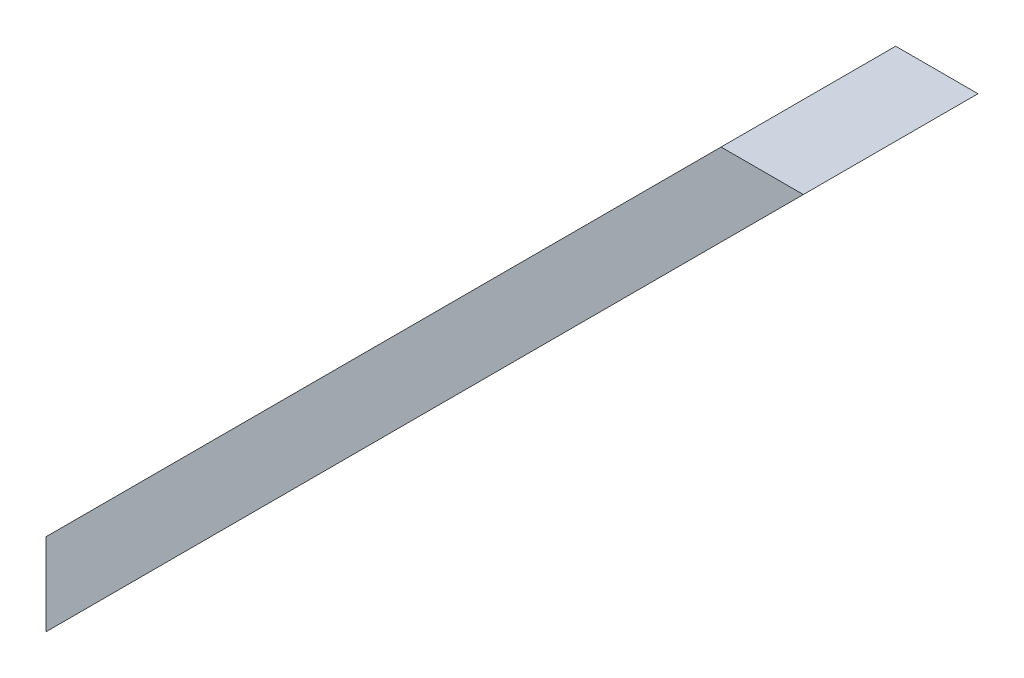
from build123d import *

# Parameters (mm, degrees)
EXTRUDE1_DEPTH = 30


with BuildPart() as part:
    # Sketch1 → Extrude1 (new body)
    with BuildSketch(Plane.XY):
        Polygon((0, -130.107647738), (130.107647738, 0), (115.965512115, 0), (0, -115.965512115), align=None)
    extrude(amount=EXTRUDE1_DEPTH)


solid = part.part
